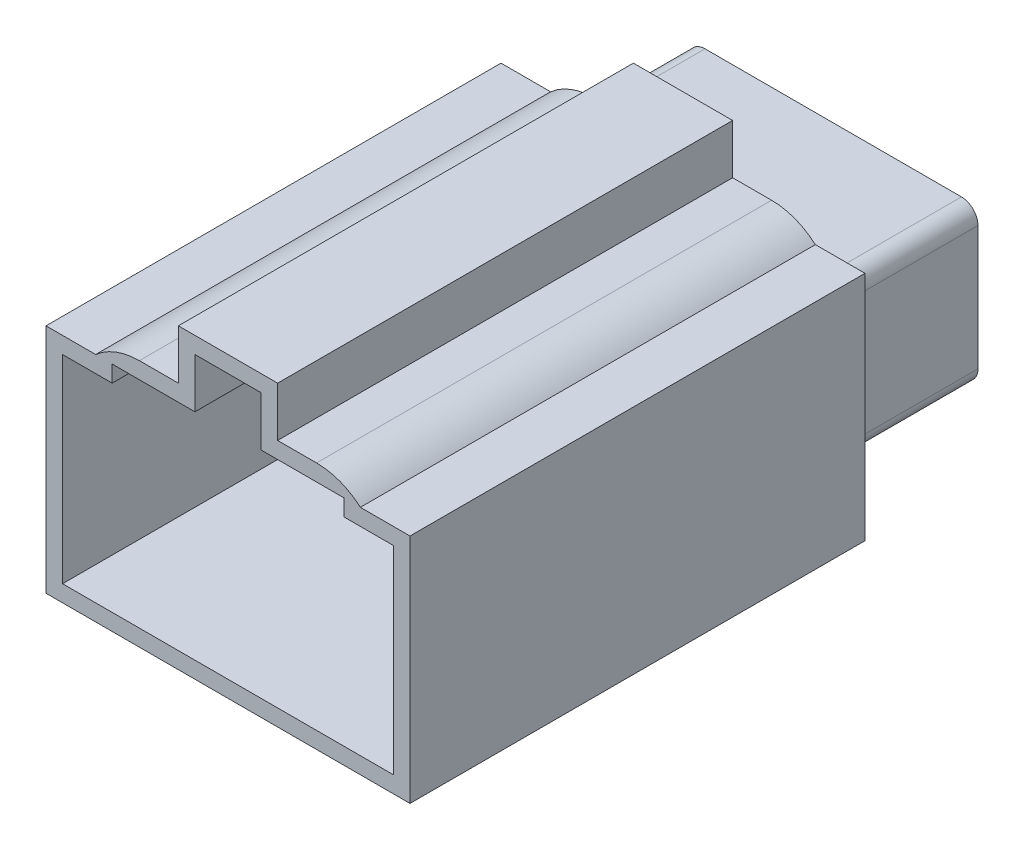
ISO-10303-21;
HEADER;
FILE_DESCRIPTION(('STEP AP214'),'2;1');
FILE_NAME('part.step','',(''),(''),'','','');
FILE_SCHEMA(('AUTOMOTIVE_DESIGN { 1 0 10303 214 1 1 1 1 }'));
ENDSEC;
DATA;
#1=APPLICATION_CONTEXT('core data for automotive mechanical design processes');
#2=APPLICATION_PROTOCOL_DEFINITION('international standard','automotive_design',2000,#1);
#3=PRODUCT_CONTEXT('',#1,'mechanical');
#4=PRODUCT('Part','Part','',(#3));
#5=PRODUCT_RELATED_PRODUCT_CATEGORY('part','',(#4));
#6=PRODUCT_DEFINITION_FORMATION('','',#4);
#7=PRODUCT_DEFINITION_CONTEXT('part definition',#1,'design');
#8=PRODUCT_DEFINITION('design','',#6,#7);
#9=PRODUCT_DEFINITION_SHAPE('','',#8);
#10=(LENGTH_UNIT() NAMED_UNIT(*) SI_UNIT(.MILLI.,.METRE.));
#11=(NAMED_UNIT(*) PLANE_ANGLE_UNIT() SI_UNIT($,.RADIAN.));
#12=(NAMED_UNIT(*) SI_UNIT($,.STERADIAN.) SOLID_ANGLE_UNIT());
#13=UNCERTAINTY_MEASURE_WITH_UNIT(LENGTH_MEASURE(1.E-05),#10,'distance_accuracy_value','');
#14=(GEOMETRIC_REPRESENTATION_CONTEXT(3) GLOBAL_UNCERTAINTY_ASSIGNED_CONTEXT((#13)) GLOBAL_UNIT_ASSIGNED_CONTEXT((#10,
#11,#12)) REPRESENTATION_CONTEXT('',''));
#15=CARTESIAN_POINT('',(0.,0.,0.));
#16=DIRECTION('',(0.,0.,1.));
#17=DIRECTION('',(1.,0.,0.));
#18=AXIS2_PLACEMENT_3D('',#15,#16,#17);
#19=CARTESIAN_POINT('',(0.,0.,5.));
#20=DIRECTION('',(0.,0.,-1.));
#21=DIRECTION('',(-1.,0.,0.));
#22=AXIS2_PLACEMENT_3D('',#19,#20,#21);
#23=PLANE('',#22);
#24=DIRECTION('',(-1.,0.,0.));
#25=VECTOR('',#24,1.);
#26=CARTESIAN_POINT('',(0.,-10.1212765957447,5.));
#27=LINE('',#26,#25);
#28=CARTESIAN_POINT('',(8.75,-10.1212765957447,5.));
#29=VERTEX_POINT('',#28);
#30=CARTESIAN_POINT('',(-11.25,-10.1212765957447,5.));
#31=VERTEX_POINT('',#30);
#32=EDGE_CURVE('E377',#29,#31,#27,.T.);
#33=ORIENTED_EDGE('',*,*,#32,.T.);
#34=DIRECTION('',(0.,1.,0.));
#35=VECTOR('',#34,1.);
#36=CARTESIAN_POINT('',(-11.25,0.,5.));
#37=LINE('',#36,#35);
#38=CARTESIAN_POINT('',(-11.25,1.87872340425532,5.));
#39=VERTEX_POINT('',#38);
#40=EDGE_CURVE('E379',#31,#39,#37,.T.);
#41=ORIENTED_EDGE('',*,*,#40,.T.);
#42=DIRECTION('',(-1.,0.,0.));
#43=VECTOR('',#42,1.);
#44=CARTESIAN_POINT('',(0.,1.87872340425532,5.));
#45=LINE('',#44,#43);
#46=CARTESIAN_POINT('',(-8.25,1.87872340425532,5.));
#47=VERTEX_POINT('',#46);
#48=EDGE_CURVE('E381',#47,#39,#45,.T.);
#49=ORIENTED_EDGE('',*,*,#48,.F.);
#50=CARTESIAN_POINT('',(5.75,1.87872340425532,5.));
#51=VERTEX_POINT('',#50);
#52=EDGE_CURVE('E386',#51,#47,#45,.T.);
#53=ORIENTED_EDGE('',*,*,#52,.F.);
#54=CARTESIAN_POINT('',(8.75,1.87872340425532,5.));
#55=VERTEX_POINT('',#54);
#56=EDGE_CURVE('E382',#55,#51,#45,.T.);
#57=ORIENTED_EDGE('',*,*,#56,.F.);
#58=DIRECTION('',(0.,1.,0.));
#59=VECTOR('',#58,1.);
#60=CARTESIAN_POINT('',(8.75,0.,5.));
#61=LINE('',#60,#59);
#62=EDGE_CURVE('E385',#29,#55,#61,.T.);
#63=ORIENTED_EDGE('',*,*,#62,.F.);
#64=EDGE_LOOP('',(#33,#41,#49,#53,#57,#63));
#65=FACE_BOUND('',#64,.T.);
#66=DIRECTION('',(1.,0.,0.));
#67=VECTOR('',#66,1.);
#68=CARTESIAN_POINT('',(0.,0.793695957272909,5.));
#69=LINE('',#68,#67);
#70=CARTESIAN_POINT('',(-8.91958696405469,0.793695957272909,5.));
#71=VERTEX_POINT('',#70);
#72=CARTESIAN_POINT('',(6.58041303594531,0.793695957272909,5.));
#73=VERTEX_POINT('',#72);
#74=EDGE_CURVE('E361',#71,#73,#69,.T.);
#75=ORIENTED_EDGE('',*,*,#74,.F.);
#76=CARTESIAN_POINT('',(-8.91958696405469,-0.206304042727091,5.));
#77=DIRECTION('',(0.,0.,-1.));
#78=DIRECTION('',(-1.,0.,0.));
#79=AXIS2_PLACEMENT_3D('',#76,#77,#78);
#80=CIRCLE('',#79,1.);
#81=CARTESIAN_POINT('',(-9.91958696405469,-0.206304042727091,5.));
#82=VERTEX_POINT('',#81);
#83=EDGE_CURVE('E11',#71,#82,#80,.F.);
#84=ORIENTED_EDGE('',*,*,#83,.T.);
#85=DIRECTION('',(0.,-1.,0.));
#86=VECTOR('',#85,1.);
#87=CARTESIAN_POINT('',(-9.91958696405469,0.,5.));
#88=LINE('',#87,#86);
#89=CARTESIAN_POINT('',(-9.91958696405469,-7.70630404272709,5.));
#90=VERTEX_POINT('',#89);
#91=EDGE_CURVE('E364',#82,#90,#88,.T.);
#92=ORIENTED_EDGE('',*,*,#91,.T.);
#93=CARTESIAN_POINT('',(-8.91958696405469,-7.70630404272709,5.));
#94=DIRECTION('',(0.,0.,-1.));
#95=DIRECTION('',(-1.,0.,0.));
#96=AXIS2_PLACEMENT_3D('',#93,#94,#95);
#97=CIRCLE('',#96,1.);
#98=CARTESIAN_POINT('',(-8.91958696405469,-8.70630404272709,5.));
#99=VERTEX_POINT('',#98);
#100=EDGE_CURVE('E43',#90,#99,#97,.F.);
#101=ORIENTED_EDGE('',*,*,#100,.T.);
#102=DIRECTION('',(1.,0.,0.));
#103=VECTOR('',#102,1.);
#104=CARTESIAN_POINT('',(0.,-8.70630404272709,5.));
#105=LINE('',#104,#103);
#106=CARTESIAN_POINT('',(6.58041303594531,-8.70630404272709,5.));
#107=VERTEX_POINT('',#106);
#108=EDGE_CURVE('E366',#99,#107,#105,.T.);
#109=ORIENTED_EDGE('',*,*,#108,.T.);
#110=CARTESIAN_POINT('',(6.58041303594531,-7.70630404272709,5.));
#111=DIRECTION('',(0.,0.,-1.));
#112=DIRECTION('',(-1.,0.,0.));
#113=AXIS2_PLACEMENT_3D('',#110,#111,#112);
#114=CIRCLE('',#113,1.);
#115=CARTESIAN_POINT('',(7.58041303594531,-7.70630404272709,5.));
#116=VERTEX_POINT('',#115);
#117=EDGE_CURVE('E622',#107,#116,#114,.F.);
#118=ORIENTED_EDGE('',*,*,#117,.T.);
#119=DIRECTION('',(0.,-1.,0.));
#120=VECTOR('',#119,1.);
#121=CARTESIAN_POINT('',(7.58041303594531,0.,5.));
#122=LINE('',#121,#120);
#123=CARTESIAN_POINT('',(7.58041303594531,-0.206304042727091,5.));
#124=VERTEX_POINT('',#123);
#125=EDGE_CURVE('E313',#124,#116,#122,.T.);
#126=ORIENTED_EDGE('',*,*,#125,.F.);
#127=CARTESIAN_POINT('',(6.58041303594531,-0.206304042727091,5.));
#128=DIRECTION('',(0.,0.,-1.));
#129=DIRECTION('',(-1.,0.,0.));
#130=AXIS2_PLACEMENT_3D('',#127,#128,#129);
#131=CIRCLE('',#130,1.);
#132=EDGE_CURVE('E624',#124,#73,#131,.F.);
#133=ORIENTED_EDGE('',*,*,#132,.T.);
#134=EDGE_LOOP('',(#75,#84,#92,#101,#109,#118,#126,#133));
#135=FACE_BOUND('',#134,.T.);
#136=ADVANCED_FACE('F35',(#65,#135),#23,.T.);
#137=CARTESIAN_POINT('',(8.75,-10.1212765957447,27.5));
#138=DIRECTION('',(-1.,0.,0.));
#139=DIRECTION('',(0.,0.,1.));
#140=AXIS2_PLACEMENT_3D('',#137,#138,#139);
#141=PLANE('',#140);
#142=DIRECTION('',(0.,0.,-1.));
#143=VECTOR('',#142,1.);
#144=CARTESIAN_POINT('',(8.75,1.87872340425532,27.5));
#145=LINE('',#144,#143);
#146=CARTESIAN_POINT('',(8.75,1.87872340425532,27.5));
#147=VERTEX_POINT('',#146);
#148=CARTESIAN_POINT('',(8.75,1.87872340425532,10.));
#149=VERTEX_POINT('',#148);
#150=EDGE_CURVE('E504',#147,#149,#145,.T.);
#151=ORIENTED_EDGE('',*,*,#150,.T.);
#152=DIRECTION('',(0.,1.,0.));
#153=VECTOR('',#152,1.);
#154=CARTESIAN_POINT('',(8.75,0.,10.));
#155=LINE('',#154,#153);
#156=CARTESIAN_POINT('',(8.75,-10.1212765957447,10.));
#157=VERTEX_POINT('',#156);
#158=EDGE_CURVE('E374',#157,#149,#155,.T.);
#159=ORIENTED_EDGE('',*,*,#158,.F.);
#160=DIRECTION('',(0.,0.,-1.));
#161=VECTOR('',#160,1.);
#162=CARTESIAN_POINT('',(8.75,-10.1212765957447,27.5));
#163=LINE('',#162,#161);
#164=CARTESIAN_POINT('',(8.75,-10.1212765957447,27.5));
#165=VERTEX_POINT('',#164);
#166=EDGE_CURVE('E472',#165,#157,#163,.T.);
#167=ORIENTED_EDGE('',*,*,#166,.F.);
#168=DIRECTION('',(0.,1.,0.));
#169=VECTOR('',#168,1.);
#170=CARTESIAN_POINT('',(8.75,-10.1212765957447,27.5));
#171=LINE('',#170,#169);
#172=EDGE_CURVE('E411',#165,#147,#171,.T.);
#173=ORIENTED_EDGE('',*,*,#172,.T.);
#174=EDGE_LOOP('',(#151,#159,#167,#173));
#175=FACE_BOUND('',#174,.T.);
#176=ADVANCED_FACE('F665',(#175),#141,.T.);
#177=CARTESIAN_POINT('',(8.75,1.87872340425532,27.5));
#178=DIRECTION('',(0.,-1.,0.));
#179=DIRECTION('',(1.,0.,0.));
#180=AXIS2_PLACEMENT_3D('',#177,#178,#179);
#181=PLANE('',#180);
#182=DIRECTION('',(0.,0.,-1.));
#183=VECTOR('',#182,1.);
#184=CARTESIAN_POINT('',(5.75,1.87872340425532,27.5));
#185=LINE('',#184,#183);
#186=CARTESIAN_POINT('',(5.75,1.87872340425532,27.5));
#187=VERTEX_POINT('',#186);
#188=CARTESIAN_POINT('',(5.75,1.87872340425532,10.));
#189=VERTEX_POINT('',#188);
#190=EDGE_CURVE('E500',#187,#189,#185,.T.);
#191=ORIENTED_EDGE('',*,*,#190,.T.);
#192=DIRECTION('',(-1.,0.,0.));
#193=VECTOR('',#192,1.);
#194=CARTESIAN_POINT('',(0.,1.87872340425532,10.));
#195=LINE('',#194,#193);
#196=EDGE_CURVE('E402',#149,#189,#195,.T.);
#197=ORIENTED_EDGE('',*,*,#196,.F.);
#198=ORIENTED_EDGE('',*,*,#150,.F.);
#199=DIRECTION('',(-1.,0.,0.));
#200=VECTOR('',#199,1.);
#201=CARTESIAN_POINT('',(8.75,1.87872340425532,27.5));
#202=LINE('',#201,#200);
#203=EDGE_CURVE('E413',#147,#187,#202,.T.);
#204=ORIENTED_EDGE('',*,*,#203,.T.);
#205=EDGE_LOOP('',(#191,#197,#198,#204));
#206=FACE_BOUND('',#205,.T.);
#207=ADVANCED_FACE('F674',(#206),#181,.T.);
#208=CARTESIAN_POINT('',(-11.25,1.87872340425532,27.5));
#209=DIRECTION('',(0.,-1.,0.));
#210=DIRECTION('',(0.,0.,-1.));
#211=AXIS2_PLACEMENT_3D('',#208,#209,#210);
#212=PLANE('',#211);
#213=DIRECTION('',(0.,0.,-1.));
#214=VECTOR('',#213,1.);
#215=CARTESIAN_POINT('',(-11.25,1.87872340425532,27.5));
#216=LINE('',#215,#214);
#217=CARTESIAN_POINT('',(-11.25,1.87872340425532,27.5));
#218=VERTEX_POINT('',#217);
#219=CARTESIAN_POINT('',(-11.25,1.87872340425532,10.));
#220=VERTEX_POINT('',#219);
#221=EDGE_CURVE('E480',#218,#220,#216,.T.);
#222=ORIENTED_EDGE('',*,*,#221,.T.);
#223=CARTESIAN_POINT('',(-8.25,1.87872340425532,10.));
#224=VERTEX_POINT('',#223);
#225=EDGE_CURVE('E401',#224,#220,#195,.T.);
#226=ORIENTED_EDGE('',*,*,#225,.F.);
#227=DIRECTION('',(0.,0.,-1.));
#228=VECTOR('',#227,1.);
#229=CARTESIAN_POINT('',(-8.25,1.87872340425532,27.5));
#230=LINE('',#229,#228);
#231=CARTESIAN_POINT('',(-8.25,1.87872340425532,27.5));
#232=VERTEX_POINT('',#231);
#233=EDGE_CURVE('E484',#232,#224,#230,.T.);
#234=ORIENTED_EDGE('',*,*,#233,.F.);
#235=DIRECTION('',(-1.,0.,0.));
#236=VECTOR('',#235,1.);
#237=CARTESIAN_POINT('',(-11.25,1.87872340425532,27.5));
#238=LINE('',#237,#236);
#239=EDGE_CURVE('E430',#232,#218,#238,.T.);
#240=ORIENTED_EDGE('',*,*,#239,.T.);
#241=EDGE_LOOP('',(#222,#226,#234,#240));
#242=FACE_BOUND('',#241,.T.);
#243=ADVANCED_FACE('F761',(#242),#212,.T.);
#244=CARTESIAN_POINT('',(-11.25,-10.1212765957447,27.5));
#245=DIRECTION('',(1.,0.,0.));
#246=DIRECTION('',(0.,0.,-1.));
#247=AXIS2_PLACEMENT_3D('',#244,#245,#246);
#248=PLANE('',#247);
#249=DIRECTION('',(0.,0.,-1.));
#250=VECTOR('',#249,1.);
#251=CARTESIAN_POINT('',(-11.25,-10.1212765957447,27.5));
#252=LINE('',#251,#250);
#253=CARTESIAN_POINT('',(-11.25,-10.1212765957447,27.5));
#254=VERTEX_POINT('',#253);
#255=CARTESIAN_POINT('',(-11.25,-10.1212765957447,10.));
#256=VERTEX_POINT('',#255);
#257=EDGE_CURVE('E476',#254,#256,#252,.T.);
#258=ORIENTED_EDGE('',*,*,#257,.T.);
#259=DIRECTION('',(0.,1.,0.));
#260=VECTOR('',#259,1.);
#261=CARTESIAN_POINT('',(-11.25,0.,10.));
#262=LINE('',#261,#260);
#263=EDGE_CURVE('E398',#256,#220,#262,.T.);
#264=ORIENTED_EDGE('',*,*,#263,.T.);
#265=ORIENTED_EDGE('',*,*,#221,.F.);
#266=DIRECTION('',(0.,-1.,0.));
#267=VECTOR('',#266,1.);
#268=CARTESIAN_POINT('',(-11.25,-10.1212765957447,27.5));
#269=LINE('',#268,#267);
#270=EDGE_CURVE('E432',#218,#254,#269,.T.);
#271=ORIENTED_EDGE('',*,*,#270,.T.);
#272=EDGE_LOOP('',(#258,#264,#265,#271));
#273=FACE_BOUND('',#272,.T.);
#274=ADVANCED_FACE('F899',(#273),#248,.T.);
#275=CARTESIAN_POINT('',(8.75,-10.1212765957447,27.5));
#276=DIRECTION('',(0.,1.,0.));
#277=DIRECTION('',(0.,0.,1.));
#278=AXIS2_PLACEMENT_3D('',#275,#276,#277);
#279=PLANE('',#278);
#280=ORIENTED_EDGE('',*,*,#166,.T.);
#281=DIRECTION('',(-1.,0.,0.));
#282=VECTOR('',#281,1.);
#283=CARTESIAN_POINT('',(0.,-10.1212765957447,10.));
#284=LINE('',#283,#282);
#285=EDGE_CURVE('E395',#157,#256,#284,.T.);
#286=ORIENTED_EDGE('',*,*,#285,.T.);
#287=ORIENTED_EDGE('',*,*,#257,.F.);
#288=DIRECTION('',(1.,0.,0.));
#289=VECTOR('',#288,1.);
#290=CARTESIAN_POINT('',(8.75,-10.1212765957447,27.5));
#291=LINE('',#290,#289);
#292=EDGE_CURVE('E435',#254,#165,#291,.T.);
#293=ORIENTED_EDGE('',*,*,#292,.T.);
#294=EDGE_LOOP('',(#280,#286,#287,#293));
#295=FACE_BOUND('',#294,.T.);
#296=ADVANCED_FACE('F711',(#295),#279,.T.);
#297=CARTESIAN_POINT('',(0.,0.,27.5));
#298=DIRECTION('',(0.,0.,-1.));
#299=DIRECTION('',(-1.,0.,0.));
#300=AXIS2_PLACEMENT_3D('',#297,#298,#299);
#301=PLANE('',#300);
#302=DIRECTION('',(-1.,0.,0.));
#303=VECTOR('',#302,1.);
#304=CARTESIAN_POINT('',(9.75,2.87872340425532,27.5));
#305=LINE('',#304,#303);
#306=CARTESIAN_POINT('',(9.75,2.87872340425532,27.5));
#307=VERTEX_POINT('',#306);
#308=CARTESIAN_POINT('',(6.75,2.87872340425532,27.5));
#309=VERTEX_POINT('',#308);
#310=EDGE_CURVE('E516',#307,#309,#305,.T.);
#311=ORIENTED_EDGE('',*,*,#310,.T.);
#312=CARTESIAN_POINT('',(4.10424868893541,-0.121276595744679,27.5));
#313=DIRECTION('',(0.,0.,-1.));
#314=DIRECTION('',(-1.,0.,0.));
#315=AXIS2_PLACEMENT_3D('',#312,#313,#314);
#316=CIRCLE('',#315,4.);
#317=CARTESIAN_POINT('',(4.10424868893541,3.87872340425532,27.5));
#318=VERTEX_POINT('',#317);
#319=EDGE_CURVE('E593',#309,#318,#316,.F.);
#320=ORIENTED_EDGE('',*,*,#319,.T.);
#321=DIRECTION('',(-1.,0.,0.));
#322=VECTOR('',#321,1.);
#323=CARTESIAN_POINT('',(6.75,3.87872340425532,27.5));
#324=LINE('',#323,#322);
#325=CARTESIAN_POINT('',(1.75,3.87872340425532,27.5));
#326=VERTEX_POINT('',#325);
#327=EDGE_CURVE('E518',#318,#326,#324,.T.);
#328=ORIENTED_EDGE('',*,*,#327,.T.);
#329=DIRECTION('',(0.,1.,0.));
#330=VECTOR('',#329,1.);
#331=CARTESIAN_POINT('',(1.75,3.87872340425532,27.5));
#332=LINE('',#331,#330);
#333=CARTESIAN_POINT('',(1.75,6.87872340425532,27.5));
#334=VERTEX_POINT('',#333);
#335=EDGE_CURVE('E520',#326,#334,#332,.T.);
#336=ORIENTED_EDGE('',*,*,#335,.T.);
#337=DIRECTION('',(-1.,0.,0.));
#338=VECTOR('',#337,1.);
#339=CARTESIAN_POINT('',(-4.25,6.87872340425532,27.5));
#340=LINE('',#339,#338);
#341=CARTESIAN_POINT('',(-4.25,6.87872340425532,27.5));
#342=VERTEX_POINT('',#341);
#343=EDGE_CURVE('E522',#334,#342,#340,.T.);
#344=ORIENTED_EDGE('',*,*,#343,.T.);
#345=DIRECTION('',(0.,-1.,0.));
#346=VECTOR('',#345,1.);
#347=CARTESIAN_POINT('',(-4.25,3.87872340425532,27.5));
#348=LINE('',#347,#346);
#349=CARTESIAN_POINT('',(-4.25,3.87872340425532,27.5));
#350=VERTEX_POINT('',#349);
#351=EDGE_CURVE('E524',#342,#350,#348,.T.);
#352=ORIENTED_EDGE('',*,*,#351,.T.);
#353=DIRECTION('',(-1.,0.,0.));
#354=VECTOR('',#353,1.);
#355=CARTESIAN_POINT('',(-9.25,3.87872340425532,27.5));
#356=LINE('',#355,#354);
#357=CARTESIAN_POINT('',(-6.60424868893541,3.87872340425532,27.5));
#358=VERTEX_POINT('',#357);
#359=EDGE_CURVE('E526',#350,#358,#356,.T.);
#360=ORIENTED_EDGE('',*,*,#359,.T.);
#361=CARTESIAN_POINT('',(-6.60424868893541,-0.121276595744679,27.5));
#362=DIRECTION('',(0.,0.,-1.));
#363=DIRECTION('',(-1.,0.,0.));
#364=AXIS2_PLACEMENT_3D('',#361,#362,#363);
#365=CIRCLE('',#364,4.);
#366=CARTESIAN_POINT('',(-9.25,2.87872340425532,27.5));
#367=VERTEX_POINT('',#366);
#368=EDGE_CURVE('E586',#358,#367,#365,.F.);
#369=ORIENTED_EDGE('',*,*,#368,.T.);
#370=DIRECTION('',(-1.,0.,0.));
#371=VECTOR('',#370,1.);
#372=CARTESIAN_POINT('',(-12.25,2.87872340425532,27.5));
#373=LINE('',#372,#371);
#374=CARTESIAN_POINT('',(-12.25,2.87872340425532,27.5));
#375=VERTEX_POINT('',#374);
#376=EDGE_CURVE('E529',#367,#375,#373,.T.);
#377=ORIENTED_EDGE('',*,*,#376,.T.);
#378=DIRECTION('',(0.,-1.,0.));
#379=VECTOR('',#378,1.);
#380=CARTESIAN_POINT('',(-12.25,-11.1212765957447,27.5));
#381=LINE('',#380,#379);
#382=CARTESIAN_POINT('',(-12.25,-11.1212765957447,27.5));
#383=VERTEX_POINT('',#382);
#384=EDGE_CURVE('E508',#375,#383,#381,.T.);
#385=ORIENTED_EDGE('',*,*,#384,.T.);
#386=DIRECTION('',(1.,0.,0.));
#387=VECTOR('',#386,1.);
#388=CARTESIAN_POINT('',(9.75,-11.1212765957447,27.5));
#389=LINE('',#388,#387);
#390=CARTESIAN_POINT('',(9.75,-11.1212765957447,27.5));
#391=VERTEX_POINT('',#390);
#392=EDGE_CURVE('E511',#383,#391,#389,.T.);
#393=ORIENTED_EDGE('',*,*,#392,.T.);
#394=DIRECTION('',(0.,1.,0.));
#395=VECTOR('',#394,1.);
#396=CARTESIAN_POINT('',(9.75,-11.1212765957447,27.5));
#397=LINE('',#396,#395);
#398=EDGE_CURVE('E514',#391,#307,#397,.T.);
#399=ORIENTED_EDGE('',*,*,#398,.T.);
#400=EDGE_LOOP('',(#311,#320,#328,#336,#344,#352,#360,#369,#377,#385,#393,#399));
#401=FACE_BOUND('',#400,.T.);
#402=ORIENTED_EDGE('',*,*,#172,.F.);
#403=ORIENTED_EDGE('',*,*,#292,.F.);
#404=ORIENTED_EDGE('',*,*,#270,.F.);
#405=ORIENTED_EDGE('',*,*,#239,.F.);
#406=DIRECTION('',(0.,-1.,0.));
#407=VECTOR('',#406,1.);
#408=CARTESIAN_POINT('',(-8.25,1.87872340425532,27.5));
#409=LINE('',#408,#407);
#410=CARTESIAN_POINT('',(-8.25,2.87872340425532,27.5));
#411=VERTEX_POINT('',#410);
#412=EDGE_CURVE('E428',#411,#232,#409,.T.);
#413=ORIENTED_EDGE('',*,*,#412,.F.);
#414=DIRECTION('',(-1.,0.,0.));
#415=VECTOR('',#414,1.);
#416=CARTESIAN_POINT('',(-8.25,2.87872340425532,27.5));
#417=LINE('',#416,#415);
#418=CARTESIAN_POINT('',(-3.25,2.87872340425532,27.5));
#419=VERTEX_POINT('',#418);
#420=EDGE_CURVE('E426',#419,#411,#417,.T.);
#421=ORIENTED_EDGE('',*,*,#420,.F.);
#422=DIRECTION('',(0.,-1.,0.));
#423=VECTOR('',#422,1.);
#424=CARTESIAN_POINT('',(-3.25,2.87872340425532,27.5));
#425=LINE('',#424,#423);
#426=CARTESIAN_POINT('',(-3.25,5.87872340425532,27.5));
#427=VERTEX_POINT('',#426);
#428=EDGE_CURVE('E424',#427,#419,#425,.T.);
#429=ORIENTED_EDGE('',*,*,#428,.F.);
#430=DIRECTION('',(-1.,0.,0.));
#431=VECTOR('',#430,1.);
#432=CARTESIAN_POINT('',(-3.25,5.87872340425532,27.5));
#433=LINE('',#432,#431);
#434=CARTESIAN_POINT('',(0.750000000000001,5.87872340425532,27.5));
#435=VERTEX_POINT('',#434);
#436=EDGE_CURVE('E422',#435,#427,#433,.T.);
#437=ORIENTED_EDGE('',*,*,#436,.F.);
#438=DIRECTION('',(0.,1.,0.));
#439=VECTOR('',#438,1.);
#440=CARTESIAN_POINT('',(0.750000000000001,2.87872340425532,27.5));
#441=LINE('',#440,#439);
#442=CARTESIAN_POINT('',(0.750000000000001,2.87872340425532,27.5));
#443=VERTEX_POINT('',#442);
#444=EDGE_CURVE('E420',#443,#435,#441,.T.);
#445=ORIENTED_EDGE('',*,*,#444,.F.);
#446=DIRECTION('',(-1.,0.,0.));
#447=VECTOR('',#446,1.);
#448=CARTESIAN_POINT('',(5.75,2.87872340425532,27.5));
#449=LINE('',#448,#447);
#450=CARTESIAN_POINT('',(5.75,2.87872340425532,27.5));
#451=VERTEX_POINT('',#450);
#452=EDGE_CURVE('E418',#451,#443,#449,.T.);
#453=ORIENTED_EDGE('',*,*,#452,.F.);
#454=DIRECTION('',(0.,1.,0.));
#455=VECTOR('',#454,1.);
#456=CARTESIAN_POINT('',(5.75,1.87872340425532,27.5));
#457=LINE('',#456,#455);
#458=EDGE_CURVE('E416',#187,#451,#457,.T.);
#459=ORIENTED_EDGE('',*,*,#458,.F.);
#460=ORIENTED_EDGE('',*,*,#203,.F.);
#461=EDGE_LOOP('',(#402,#403,#404,#405,#413,#421,#429,#437,#445,#453,#459,#460));
#462=FACE_BOUND('',#461,.T.);
#463=ADVANCED_FACE('F715',(#401,#462),#301,.F.);
#464=CARTESIAN_POINT('',(0.,0.,0.));
#465=DIRECTION('',(0.,0.,-1.));
#466=DIRECTION('',(-1.,0.,0.));
#467=AXIS2_PLACEMENT_3D('',#464,#465,#466);
#468=PLANE('',#467);
#469=DIRECTION('',(-1.,0.,0.));
#470=VECTOR('',#469,1.);
#471=CARTESIAN_POINT('',(6.75,3.87872340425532,0.));
#472=LINE('',#471,#470);
#473=CARTESIAN_POINT('',(4.10424868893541,3.87872340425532,0.));
#474=VERTEX_POINT('',#473);
#475=CARTESIAN_POINT('',(1.75,3.87872340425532,0.));
#476=VERTEX_POINT('',#475);
#477=EDGE_CURVE('E541',#474,#476,#472,.T.);
#478=ORIENTED_EDGE('',*,*,#477,.F.);
#479=CARTESIAN_POINT('',(4.10424868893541,-0.121276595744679,0.));
#480=DIRECTION('',(0.,0.,-1.));
#481=DIRECTION('',(-1.,0.,0.));
#482=AXIS2_PLACEMENT_3D('',#479,#480,#481);
#483=CIRCLE('',#482,4.);
#484=CARTESIAN_POINT('',(6.75,2.87872340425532,0.));
#485=VERTEX_POINT('',#484);
#486=EDGE_CURVE('E591',#474,#485,#483,.T.);
#487=ORIENTED_EDGE('',*,*,#486,.T.);
#488=DIRECTION('',(-1.,0.,0.));
#489=VECTOR('',#488,1.);
#490=CARTESIAN_POINT('',(9.75,2.87872340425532,0.));
#491=LINE('',#490,#489);
#492=CARTESIAN_POINT('',(9.75,2.87872340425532,0.));
#493=VERTEX_POINT('',#492);
#494=EDGE_CURVE('E538',#493,#485,#491,.T.);
#495=ORIENTED_EDGE('',*,*,#494,.F.);
#496=DIRECTION('',(0.,1.,0.));
#497=VECTOR('',#496,1.);
#498=CARTESIAN_POINT('',(9.75,-11.1212765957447,0.));
#499=LINE('',#498,#497);
#500=CARTESIAN_POINT('',(9.75,-11.1212765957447,0.));
#501=VERTEX_POINT('',#500);
#502=EDGE_CURVE('E536',#501,#493,#499,.T.);
#503=ORIENTED_EDGE('',*,*,#502,.F.);
#504=DIRECTION('',(1.,0.,0.));
#505=VECTOR('',#504,1.);
#506=CARTESIAN_POINT('',(9.75,-11.1212765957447,0.));
#507=LINE('',#506,#505);
#508=CARTESIAN_POINT('',(-12.25,-11.1212765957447,0.));
#509=VERTEX_POINT('',#508);
#510=EDGE_CURVE('E534',#509,#501,#507,.T.);
#511=ORIENTED_EDGE('',*,*,#510,.F.);
#512=DIRECTION('',(0.,-1.,0.));
#513=VECTOR('',#512,1.);
#514=CARTESIAN_POINT('',(-12.25,-11.1212765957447,0.));
#515=LINE('',#514,#513);
#516=CARTESIAN_POINT('',(-12.25,2.87872340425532,0.));
#517=VERTEX_POINT('',#516);
#518=EDGE_CURVE('E507',#517,#509,#515,.T.);
#519=ORIENTED_EDGE('',*,*,#518,.F.);
#520=DIRECTION('',(-1.,0.,0.));
#521=VECTOR('',#520,1.);
#522=CARTESIAN_POINT('',(-12.25,2.87872340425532,0.));
#523=LINE('',#522,#521);
#524=CARTESIAN_POINT('',(-9.25,2.87872340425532,0.));
#525=VERTEX_POINT('',#524);
#526=EDGE_CURVE('E512',#525,#517,#523,.T.);
#527=ORIENTED_EDGE('',*,*,#526,.F.);
#528=CARTESIAN_POINT('',(-6.60424868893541,-0.121276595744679,0.));
#529=DIRECTION('',(0.,0.,-1.));
#530=DIRECTION('',(-1.,0.,0.));
#531=AXIS2_PLACEMENT_3D('',#528,#529,#530);
#532=CIRCLE('',#531,4.);
#533=CARTESIAN_POINT('',(-6.60424868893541,3.87872340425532,0.));
#534=VERTEX_POINT('',#533);
#535=EDGE_CURVE('E582',#525,#534,#532,.T.);
#536=ORIENTED_EDGE('',*,*,#535,.T.);
#537=DIRECTION('',(-1.,0.,0.));
#538=VECTOR('',#537,1.);
#539=CARTESIAN_POINT('',(-9.25,3.87872340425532,0.));
#540=LINE('',#539,#538);
#541=CARTESIAN_POINT('',(-4.25,3.87872340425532,0.));
#542=VERTEX_POINT('',#541);
#543=EDGE_CURVE('E549',#542,#534,#540,.T.);
#544=ORIENTED_EDGE('',*,*,#543,.F.);
#545=DIRECTION('',(0.,-1.,0.));
#546=VECTOR('',#545,1.);
#547=CARTESIAN_POINT('',(-4.25,3.87872340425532,0.));
#548=LINE('',#547,#546);
#549=CARTESIAN_POINT('',(-4.25,6.87872340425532,0.));
#550=VERTEX_POINT('',#549);
#551=EDGE_CURVE('E547',#550,#542,#548,.T.);
#552=ORIENTED_EDGE('',*,*,#551,.F.);
#553=DIRECTION('',(-1.,0.,0.));
#554=VECTOR('',#553,1.);
#555=CARTESIAN_POINT('',(-4.25,6.87872340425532,0.));
#556=LINE('',#555,#554);
#557=CARTESIAN_POINT('',(1.75,6.87872340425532,0.));
#558=VERTEX_POINT('',#557);
#559=EDGE_CURVE('E545',#558,#550,#556,.T.);
#560=ORIENTED_EDGE('',*,*,#559,.F.);
#561=DIRECTION('',(0.,1.,0.));
#562=VECTOR('',#561,1.);
#563=CARTESIAN_POINT('',(1.75,3.87872340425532,0.));
#564=LINE('',#563,#562);
#565=EDGE_CURVE('E543',#476,#558,#564,.T.);
#566=ORIENTED_EDGE('',*,*,#565,.F.);
#567=EDGE_LOOP('',(#478,#487,#495,#503,#511,#519,#527,#536,#544,#552,#560,#566));
#568=FACE_BOUND('',#567,.T.);
#569=DIRECTION('',(1.,0.,0.));
#570=VECTOR('',#569,1.);
#571=CARTESIAN_POINT('',(8.75,-10.1212765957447,0.));
#572=LINE('',#571,#570);
#573=CARTESIAN_POINT('',(-11.25,-10.1212765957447,0.));
#574=VERTEX_POINT('',#573);
#575=CARTESIAN_POINT('',(8.75,-10.1212765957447,0.));
#576=VERTEX_POINT('',#575);
#577=EDGE_CURVE('E414',#574,#576,#572,.T.);
#578=ORIENTED_EDGE('',*,*,#577,.T.);
#579=DIRECTION('',(0.,1.,0.));
#580=VECTOR('',#579,1.);
#581=CARTESIAN_POINT('',(8.75,-10.1212765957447,0.));
#582=LINE('',#581,#580);
#583=CARTESIAN_POINT('',(8.75,1.87872340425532,0.));
#584=VERTEX_POINT('',#583);
#585=EDGE_CURVE('E410',#576,#584,#582,.T.);
#586=ORIENTED_EDGE('',*,*,#585,.T.);
#587=DIRECTION('',(-1.,0.,0.));
#588=VECTOR('',#587,1.);
#589=CARTESIAN_POINT('',(8.75,1.87872340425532,0.));
#590=LINE('',#589,#588);
#591=CARTESIAN_POINT('',(5.75,1.87872340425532,0.));
#592=VERTEX_POINT('',#591);
#593=EDGE_CURVE('E440',#584,#592,#590,.T.);
#594=ORIENTED_EDGE('',*,*,#593,.T.);
#595=DIRECTION('',(0.,1.,0.));
#596=VECTOR('',#595,1.);
#597=CARTESIAN_POINT('',(5.75,1.87872340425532,0.));
#598=LINE('',#597,#596);
#599=CARTESIAN_POINT('',(5.75,2.87872340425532,0.));
#600=VERTEX_POINT('',#599);
#601=EDGE_CURVE('E443',#592,#600,#598,.T.);
#602=ORIENTED_EDGE('',*,*,#601,.T.);
#603=DIRECTION('',(-1.,0.,0.));
#604=VECTOR('',#603,1.);
#605=CARTESIAN_POINT('',(5.75,2.87872340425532,0.));
#606=LINE('',#605,#604);
#607=CARTESIAN_POINT('',(0.750000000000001,2.87872340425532,0.));
#608=VERTEX_POINT('',#607);
#609=EDGE_CURVE('E446',#600,#608,#606,.T.);
#610=ORIENTED_EDGE('',*,*,#609,.T.);
#611=DIRECTION('',(0.,1.,0.));
#612=VECTOR('',#611,1.);
#613=CARTESIAN_POINT('',(0.750000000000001,2.87872340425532,0.));
#614=LINE('',#613,#612);
#615=CARTESIAN_POINT('',(0.750000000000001,5.87872340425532,0.));
#616=VERTEX_POINT('',#615);
#617=EDGE_CURVE('E449',#608,#616,#614,.T.);
#618=ORIENTED_EDGE('',*,*,#617,.T.);
#619=DIRECTION('',(-1.,0.,0.));
#620=VECTOR('',#619,1.);
#621=CARTESIAN_POINT('',(-3.25,5.87872340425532,0.));
#622=LINE('',#621,#620);
#623=CARTESIAN_POINT('',(-3.25,5.87872340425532,0.));
#624=VERTEX_POINT('',#623);
#625=EDGE_CURVE('E452',#616,#624,#622,.T.);
#626=ORIENTED_EDGE('',*,*,#625,.T.);
#627=DIRECTION('',(0.,-1.,0.));
#628=VECTOR('',#627,1.);
#629=CARTESIAN_POINT('',(-3.25,2.87872340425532,0.));
#630=LINE('',#629,#628);
#631=CARTESIAN_POINT('',(-3.25,2.87872340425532,0.));
#632=VERTEX_POINT('',#631);
#633=EDGE_CURVE('E455',#624,#632,#630,.T.);
#634=ORIENTED_EDGE('',*,*,#633,.T.);
#635=DIRECTION('',(-1.,0.,0.));
#636=VECTOR('',#635,1.);
#637=CARTESIAN_POINT('',(-8.25,2.87872340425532,0.));
#638=LINE('',#637,#636);
#639=CARTESIAN_POINT('',(-8.25,2.87872340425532,0.));
#640=VERTEX_POINT('',#639);
#641=EDGE_CURVE('E458',#632,#640,#638,.T.);
#642=ORIENTED_EDGE('',*,*,#641,.T.);
#643=DIRECTION('',(0.,-1.,0.));
#644=VECTOR('',#643,1.);
#645=CARTESIAN_POINT('',(-8.25,1.87872340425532,0.));
#646=LINE('',#645,#644);
#647=CARTESIAN_POINT('',(-8.25,1.87872340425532,0.));
#648=VERTEX_POINT('',#647);
#649=EDGE_CURVE('E461',#640,#648,#646,.T.);
#650=ORIENTED_EDGE('',*,*,#649,.T.);
#651=DIRECTION('',(-1.,0.,0.));
#652=VECTOR('',#651,1.);
#653=CARTESIAN_POINT('',(-11.25,1.87872340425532,0.));
#654=LINE('',#653,#652);
#655=CARTESIAN_POINT('',(-11.25,1.87872340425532,0.));
#656=VERTEX_POINT('',#655);
#657=EDGE_CURVE('E464',#648,#656,#654,.T.);
#658=ORIENTED_EDGE('',*,*,#657,.T.);
#659=DIRECTION('',(0.,-1.,0.));
#660=VECTOR('',#659,1.);
#661=CARTESIAN_POINT('',(-11.25,-10.1212765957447,0.));
#662=LINE('',#661,#660);
#663=EDGE_CURVE('E467',#656,#574,#662,.T.);
#664=ORIENTED_EDGE('',*,*,#663,.T.);
#665=EDGE_LOOP('',(#578,#586,#594,#602,#610,#618,#626,#634,#642,#650,#658,#664));
#666=FACE_BOUND('',#665,.T.);
#667=ADVANCED_FACE('F771',(#568,#666),#468,.T.);
#668=CARTESIAN_POINT('',(-12.25,-11.1212765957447,27.5));
#669=DIRECTION('',(1.,0.,0.));
#670=DIRECTION('',(0.,0.,-1.));
#671=AXIS2_PLACEMENT_3D('',#668,#669,#670);
#672=PLANE('',#671);
#673=ORIENTED_EDGE('',*,*,#518,.T.);
#674=DIRECTION('',(0.,0.,-1.));
#675=VECTOR('',#674,1.);
#676=CARTESIAN_POINT('',(-12.25,-11.1212765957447,27.5));
#677=LINE('',#676,#675);
#678=EDGE_CURVE('E579',#383,#509,#677,.T.);
#679=ORIENTED_EDGE('',*,*,#678,.F.);
#680=ORIENTED_EDGE('',*,*,#384,.F.);
#681=DIRECTION('',(0.,0.,-1.));
#682=VECTOR('',#681,1.);
#683=CARTESIAN_POINT('',(-12.25,2.87872340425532,27.5));
#684=LINE('',#683,#682);
#685=EDGE_CURVE('E531',#375,#517,#684,.T.);
#686=ORIENTED_EDGE('',*,*,#685,.T.);
#687=EDGE_LOOP('',(#673,#679,#680,#686));
#688=FACE_BOUND('',#687,.T.);
#689=ADVANCED_FACE('F810',(#688),#672,.F.);
#690=CARTESIAN_POINT('',(9.75,-11.1212765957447,27.5));
#691=DIRECTION('',(0.,1.,0.));
#692=DIRECTION('',(0.,0.,1.));
#693=AXIS2_PLACEMENT_3D('',#690,#691,#692);
#694=PLANE('',#693);
#695=ORIENTED_EDGE('',*,*,#510,.T.);
#696=DIRECTION('',(0.,0.,-1.));
#697=VECTOR('',#696,1.);
#698=CARTESIAN_POINT('',(9.75,-11.1212765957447,27.5));
#699=LINE('',#698,#697);
#700=EDGE_CURVE('E576',#391,#501,#699,.T.);
#701=ORIENTED_EDGE('',*,*,#700,.F.);
#702=ORIENTED_EDGE('',*,*,#392,.F.);
#703=ORIENTED_EDGE('',*,*,#678,.T.);
#704=EDGE_LOOP('',(#695,#701,#702,#703));
#705=FACE_BOUND('',#704,.T.);
#706=ADVANCED_FACE('F842',(#705),#694,.F.);
#707=CARTESIAN_POINT('',(9.75,-11.1212765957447,27.5));
#708=DIRECTION('',(-1.,0.,0.));
#709=DIRECTION('',(0.,0.,1.));
#710=AXIS2_PLACEMENT_3D('',#707,#708,#709);
#711=PLANE('',#710);
#712=ORIENTED_EDGE('',*,*,#502,.T.);
#713=DIRECTION('',(0.,0.,-1.));
#714=VECTOR('',#713,1.);
#715=CARTESIAN_POINT('',(9.75,2.87872340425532,27.5));
#716=LINE('',#715,#714);
#717=EDGE_CURVE('E573',#307,#493,#716,.T.);
#718=ORIENTED_EDGE('',*,*,#717,.F.);
#719=ORIENTED_EDGE('',*,*,#398,.F.);
#720=ORIENTED_EDGE('',*,*,#700,.T.);
#721=EDGE_LOOP('',(#712,#718,#719,#720));
#722=FACE_BOUND('',#721,.T.);
#723=ADVANCED_FACE('F838',(#722),#711,.F.);
#724=CARTESIAN_POINT('',(9.75,2.87872340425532,27.5));
#725=DIRECTION('',(0.,-1.,0.));
#726=DIRECTION('',(0.,0.,-1.));
#727=AXIS2_PLACEMENT_3D('',#724,#725,#726);
#728=PLANE('',#727);
#729=ORIENTED_EDGE('',*,*,#494,.T.);
#730=DIRECTION('',(0.,0.,-1.));
#731=VECTOR('',#730,1.);
#732=CARTESIAN_POINT('',(6.75,2.87872340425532,27.5));
#733=LINE('',#732,#731);
#734=EDGE_CURVE('E570',#309,#485,#733,.T.);
#735=ORIENTED_EDGE('',*,*,#734,.F.);
#736=ORIENTED_EDGE('',*,*,#310,.F.);
#737=ORIENTED_EDGE('',*,*,#717,.T.);
#738=EDGE_LOOP('',(#729,#735,#736,#737));
#739=FACE_BOUND('',#738,.T.);
#740=ADVANCED_FACE('F834',(#739),#728,.F.);
#741=CARTESIAN_POINT('',(6.75,3.87872340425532,27.5));
#742=DIRECTION('',(0.,-1.,0.));
#743=DIRECTION('',(1.,0.,0.));
#744=AXIS2_PLACEMENT_3D('',#741,#742,#743);
#745=PLANE('',#744);
#746=ORIENTED_EDGE('',*,*,#327,.F.);
#747=DIRECTION('',(0.,0.,1.));
#748=VECTOR('',#747,1.);
#749=CARTESIAN_POINT('',(4.10424868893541,3.87872340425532,27.5));
#750=LINE('',#749,#748);
#751=EDGE_CURVE('E588',#318,#474,#750,.F.);
#752=ORIENTED_EDGE('',*,*,#751,.T.);
#753=ORIENTED_EDGE('',*,*,#477,.T.);
#754=DIRECTION('',(0.,0.,-1.));
#755=VECTOR('',#754,1.);
#756=CARTESIAN_POINT('',(1.75,3.87872340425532,27.5));
#757=LINE('',#756,#755);
#758=EDGE_CURVE('E567',#326,#476,#757,.T.);
#759=ORIENTED_EDGE('',*,*,#758,.F.);
#760=EDGE_LOOP('',(#746,#752,#753,#759));
#761=FACE_BOUND('',#760,.T.);
#762=ADVANCED_FACE('F830',(#761),#745,.F.);
#763=CARTESIAN_POINT('',(1.75,3.87872340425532,27.5));
#764=DIRECTION('',(-1.,0.,0.));
#765=DIRECTION('',(0.,-1.,0.));
#766=AXIS2_PLACEMENT_3D('',#763,#764,#765);
#767=PLANE('',#766);
#768=ORIENTED_EDGE('',*,*,#565,.T.);
#769=DIRECTION('',(0.,0.,-1.));
#770=VECTOR('',#769,1.);
#771=CARTESIAN_POINT('',(1.75,6.87872340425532,27.5));
#772=LINE('',#771,#770);
#773=EDGE_CURVE('E564',#334,#558,#772,.T.);
#774=ORIENTED_EDGE('',*,*,#773,.F.);
#775=ORIENTED_EDGE('',*,*,#335,.F.);
#776=ORIENTED_EDGE('',*,*,#758,.T.);
#777=EDGE_LOOP('',(#768,#774,#775,#776));
#778=FACE_BOUND('',#777,.T.);
#779=ADVANCED_FACE('F826',(#778),#767,.F.);
#780=CARTESIAN_POINT('',(-4.25,6.87872340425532,27.5));
#781=DIRECTION('',(0.,-1.,0.));
#782=DIRECTION('',(0.,0.,-1.));
#783=AXIS2_PLACEMENT_3D('',#780,#781,#782);
#784=PLANE('',#783);
#785=ORIENTED_EDGE('',*,*,#559,.T.);
#786=DIRECTION('',(0.,0.,-1.));
#787=VECTOR('',#786,1.);
#788=CARTESIAN_POINT('',(-4.25,6.87872340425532,27.5));
#789=LINE('',#788,#787);
#790=EDGE_CURVE('E561',#342,#550,#789,.T.);
#791=ORIENTED_EDGE('',*,*,#790,.F.);
#792=ORIENTED_EDGE('',*,*,#343,.F.);
#793=ORIENTED_EDGE('',*,*,#773,.T.);
#794=EDGE_LOOP('',(#785,#791,#792,#793));
#795=FACE_BOUND('',#794,.T.);
#796=ADVANCED_FACE('F822',(#795),#784,.F.);
#797=CARTESIAN_POINT('',(-4.25,3.87872340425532,27.5));
#798=DIRECTION('',(1.,0.,0.));
#799=DIRECTION('',(0.,1.,0.));
#800=AXIS2_PLACEMENT_3D('',#797,#798,#799);
#801=PLANE('',#800);
#802=ORIENTED_EDGE('',*,*,#551,.T.);
#803=DIRECTION('',(0.,0.,-1.));
#804=VECTOR('',#803,1.);
#805=CARTESIAN_POINT('',(-4.25,3.87872340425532,27.5));
#806=LINE('',#805,#804);
#807=EDGE_CURVE('E558',#350,#542,#806,.T.);
#808=ORIENTED_EDGE('',*,*,#807,.F.);
#809=ORIENTED_EDGE('',*,*,#351,.F.);
#810=ORIENTED_EDGE('',*,*,#790,.T.);
#811=EDGE_LOOP('',(#802,#808,#809,#810));
#812=FACE_BOUND('',#811,.T.);
#813=ADVANCED_FACE('F818',(#812),#801,.F.);
#814=CARTESIAN_POINT('',(-9.25,3.87872340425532,27.5));
#815=DIRECTION('',(0.,-1.,0.));
#816=DIRECTION('',(1.,0.,0.));
#817=AXIS2_PLACEMENT_3D('',#814,#815,#816);
#818=PLANE('',#817);
#819=ORIENTED_EDGE('',*,*,#543,.T.);
#820=DIRECTION('',(0.,0.,-1.));
#821=VECTOR('',#820,1.);
#822=CARTESIAN_POINT('',(-6.60424868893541,3.87872340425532,27.5));
#823=LINE('',#822,#821);
#824=EDGE_CURVE('E584',#534,#358,#823,.F.);
#825=ORIENTED_EDGE('',*,*,#824,.T.);
#826=ORIENTED_EDGE('',*,*,#359,.F.);
#827=ORIENTED_EDGE('',*,*,#807,.T.);
#828=EDGE_LOOP('',(#819,#825,#826,#827));
#829=FACE_BOUND('',#828,.T.);
#830=ADVANCED_FACE('F814',(#829),#818,.F.);
#831=CARTESIAN_POINT('',(-12.25,2.87872340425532,27.5));
#832=DIRECTION('',(0.,-1.,0.));
#833=DIRECTION('',(0.,0.,-1.));
#834=AXIS2_PLACEMENT_3D('',#831,#832,#833);
#835=PLANE('',#834);
#836=ORIENTED_EDGE('',*,*,#526,.T.);
#837=ORIENTED_EDGE('',*,*,#685,.F.);
#838=ORIENTED_EDGE('',*,*,#376,.F.);
#839=DIRECTION('',(0.,0.,-1.));
#840=VECTOR('',#839,1.);
#841=CARTESIAN_POINT('',(-9.25,2.87872340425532,27.5));
#842=LINE('',#841,#840);
#843=EDGE_CURVE('E555',#367,#525,#842,.T.);
#844=ORIENTED_EDGE('',*,*,#843,.T.);
#845=EDGE_LOOP('',(#836,#837,#838,#844));
#846=FACE_BOUND('',#845,.T.);
#847=ADVANCED_FACE('F804',(#846),#835,.F.);
#848=ORIENTED_EDGE('',*,*,#62,.T.);
#849=EDGE_CURVE('E503',#55,#584,#145,.T.);
#850=ORIENTED_EDGE('',*,*,#849,.T.);
#851=ORIENTED_EDGE('',*,*,#585,.F.);
#852=EDGE_CURVE('E437',#29,#576,#163,.T.);
#853=ORIENTED_EDGE('',*,*,#852,.F.);
#854=EDGE_LOOP('',(#848,#850,#851,#853));
#855=FACE_BOUND('',#854,.T.);
#856=ADVANCED_FACE('F677',(#855),#141,.T.);
#857=ORIENTED_EDGE('',*,*,#56,.T.);
#858=EDGE_CURVE('E499',#51,#592,#185,.T.);
#859=ORIENTED_EDGE('',*,*,#858,.T.);
#860=ORIENTED_EDGE('',*,*,#593,.F.);
#861=ORIENTED_EDGE('',*,*,#849,.F.);
#862=EDGE_LOOP('',(#857,#859,#860,#861));
#863=FACE_BOUND('',#862,.T.);
#864=ADVANCED_FACE('F735',(#863),#181,.T.);
#865=CARTESIAN_POINT('',(5.75,1.87872340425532,27.5));
#866=DIRECTION('',(-1.,0.,0.));
#867=DIRECTION('',(0.,0.,1.));
#868=AXIS2_PLACEMENT_3D('',#865,#866,#867);
#869=PLANE('',#868);
#870=ORIENTED_EDGE('',*,*,#601,.F.);
#871=ORIENTED_EDGE('',*,*,#858,.F.);
#872=DIRECTION('',(0.,0.,-1.));
#873=VECTOR('',#872,1.);
#874=CARTESIAN_POINT('',(5.75,1.87872340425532,27.5));
#875=LINE('',#874,#873);
#876=EDGE_CURVE('E408',#189,#51,#875,.T.);
#877=ORIENTED_EDGE('',*,*,#876,.F.);
#878=ORIENTED_EDGE('',*,*,#190,.F.);
#879=ORIENTED_EDGE('',*,*,#458,.T.);
#880=DIRECTION('',(0.,0.,-1.));
#881=VECTOR('',#880,1.);
#882=CARTESIAN_POINT('',(5.75,2.87872340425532,27.5));
#883=LINE('',#882,#881);
#884=EDGE_CURVE('E497',#451,#600,#883,.T.);
#885=ORIENTED_EDGE('',*,*,#884,.T.);
#886=EDGE_LOOP('',(#870,#871,#877,#878,#879,#885));
#887=FACE_BOUND('',#886,.T.);
#888=ADVANCED_FACE('F727',(#887),#869,.T.);
#889=CARTESIAN_POINT('',(5.75,2.87872340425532,27.5));
#890=DIRECTION('',(0.,-1.,0.));
#891=DIRECTION('',(0.,0.,-1.));
#892=AXIS2_PLACEMENT_3D('',#889,#890,#891);
#893=PLANE('',#892);
#894=ORIENTED_EDGE('',*,*,#609,.F.);
#895=ORIENTED_EDGE('',*,*,#884,.F.);
#896=ORIENTED_EDGE('',*,*,#452,.T.);
#897=DIRECTION('',(0.,0.,-1.));
#898=VECTOR('',#897,1.);
#899=CARTESIAN_POINT('',(0.750000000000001,2.87872340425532,27.5));
#900=LINE('',#899,#898);
#901=EDGE_CURVE('E495',#443,#608,#900,.T.);
#902=ORIENTED_EDGE('',*,*,#901,.T.);
#903=EDGE_LOOP('',(#894,#895,#896,#902));
#904=FACE_BOUND('',#903,.T.);
#905=ADVANCED_FACE('F788',(#904),#893,.T.);
#906=CARTESIAN_POINT('',(0.750000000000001,2.87872340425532,27.5));
#907=DIRECTION('',(-1.,0.,0.));
#908=DIRECTION('',(0.,0.,1.));
#909=AXIS2_PLACEMENT_3D('',#906,#907,#908);
#910=PLANE('',#909);
#911=ORIENTED_EDGE('',*,*,#617,.F.);
#912=ORIENTED_EDGE('',*,*,#901,.F.);
#913=ORIENTED_EDGE('',*,*,#444,.T.);
#914=DIRECTION('',(0.,0.,-1.));
#915=VECTOR('',#914,1.);
#916=CARTESIAN_POINT('',(0.750000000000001,5.87872340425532,27.5));
#917=LINE('',#916,#915);
#918=EDGE_CURVE('E493',#435,#616,#917,.T.);
#919=ORIENTED_EDGE('',*,*,#918,.T.);
#920=EDGE_LOOP('',(#911,#912,#913,#919));
#921=FACE_BOUND('',#920,.T.);
#922=ADVANCED_FACE('F785',(#921),#910,.T.);
#923=CARTESIAN_POINT('',(-3.25,5.87872340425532,27.5));
#924=DIRECTION('',(0.,-1.,0.));
#925=DIRECTION('',(0.,0.,-1.));
#926=AXIS2_PLACEMENT_3D('',#923,#924,#925);
#927=PLANE('',#926);
#928=ORIENTED_EDGE('',*,*,#625,.F.);
#929=ORIENTED_EDGE('',*,*,#918,.F.);
#930=ORIENTED_EDGE('',*,*,#436,.T.);
#931=DIRECTION('',(0.,0.,-1.));
#932=VECTOR('',#931,1.);
#933=CARTESIAN_POINT('',(-3.25,5.87872340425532,27.5));
#934=LINE('',#933,#932);
#935=EDGE_CURVE('E491',#427,#624,#934,.T.);
#936=ORIENTED_EDGE('',*,*,#935,.T.);
#937=EDGE_LOOP('',(#928,#929,#930,#936));
#938=FACE_BOUND('',#937,.T.);
#939=ADVANCED_FACE('F778',(#938),#927,.T.);
#940=CARTESIAN_POINT('',(-3.25,2.87872340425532,27.5));
#941=DIRECTION('',(1.,0.,0.));
#942=DIRECTION('',(0.,0.,-1.));
#943=AXIS2_PLACEMENT_3D('',#940,#941,#942);
#944=PLANE('',#943);
#945=ORIENTED_EDGE('',*,*,#633,.F.);
#946=ORIENTED_EDGE('',*,*,#935,.F.);
#947=ORIENTED_EDGE('',*,*,#428,.T.);
#948=DIRECTION('',(0.,0.,-1.));
#949=VECTOR('',#948,1.);
#950=CARTESIAN_POINT('',(-3.25,2.87872340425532,27.5));
#951=LINE('',#950,#949);
#952=EDGE_CURVE('E489',#419,#632,#951,.T.);
#953=ORIENTED_EDGE('',*,*,#952,.T.);
#954=EDGE_LOOP('',(#945,#946,#947,#953));
#955=FACE_BOUND('',#954,.T.);
#956=ADVANCED_FACE('F776',(#955),#944,.T.);
#957=CARTESIAN_POINT('',(-8.25,2.87872340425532,27.5));
#958=DIRECTION('',(0.,-1.,0.));
#959=DIRECTION('',(0.,0.,-1.));
#960=AXIS2_PLACEMENT_3D('',#957,#958,#959);
#961=PLANE('',#960);
#962=ORIENTED_EDGE('',*,*,#641,.F.);
#963=ORIENTED_EDGE('',*,*,#952,.F.);
#964=ORIENTED_EDGE('',*,*,#420,.T.);
#965=DIRECTION('',(0.,0.,-1.));
#966=VECTOR('',#965,1.);
#967=CARTESIAN_POINT('',(-8.25,2.87872340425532,27.5));
#968=LINE('',#967,#966);
#969=EDGE_CURVE('E487',#411,#640,#968,.T.);
#970=ORIENTED_EDGE('',*,*,#969,.T.);
#971=EDGE_LOOP('',(#962,#963,#964,#970));
#972=FACE_BOUND('',#971,.T.);
#973=ADVANCED_FACE('F769',(#972),#961,.T.);
#974=CARTESIAN_POINT('',(-8.25,1.87872340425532,27.5));
#975=DIRECTION('',(1.,0.,0.));
#976=DIRECTION('',(0.,0.,-1.));
#977=AXIS2_PLACEMENT_3D('',#974,#975,#976);
#978=PLANE('',#977);
#979=ORIENTED_EDGE('',*,*,#649,.F.);
#980=ORIENTED_EDGE('',*,*,#969,.F.);
#981=ORIENTED_EDGE('',*,*,#412,.T.);
#982=ORIENTED_EDGE('',*,*,#233,.T.);
#983=DIRECTION('',(0.,0.,1.));
#984=VECTOR('',#983,1.);
#985=CARTESIAN_POINT('',(-8.25,1.87872340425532,27.5));
#986=LINE('',#985,#984);
#987=EDGE_CURVE('E389',#47,#224,#986,.T.);
#988=ORIENTED_EDGE('',*,*,#987,.F.);
#989=EDGE_CURVE('E483',#47,#648,#230,.T.);
#990=ORIENTED_EDGE('',*,*,#989,.T.);
#991=EDGE_LOOP('',(#979,#980,#981,#982,#988,#990));
#992=FACE_BOUND('',#991,.T.);
#993=ADVANCED_FACE('F756',(#992),#978,.T.);
#994=ORIENTED_EDGE('',*,*,#48,.T.);
#995=EDGE_CURVE('E479',#39,#656,#216,.T.);
#996=ORIENTED_EDGE('',*,*,#995,.T.);
#997=ORIENTED_EDGE('',*,*,#657,.F.);
#998=ORIENTED_EDGE('',*,*,#989,.F.);
#999=EDGE_LOOP('',(#994,#996,#997,#998));
#1000=FACE_BOUND('',#999,.T.);
#1001=ADVANCED_FACE('F751',(#1000),#212,.T.);
#1002=ORIENTED_EDGE('',*,*,#40,.F.);
#1003=EDGE_CURVE('E475',#31,#574,#252,.T.);
#1004=ORIENTED_EDGE('',*,*,#1003,.T.);
#1005=ORIENTED_EDGE('',*,*,#663,.F.);
#1006=ORIENTED_EDGE('',*,*,#995,.F.);
#1007=EDGE_LOOP('',(#1002,#1004,#1005,#1006));
#1008=FACE_BOUND('',#1007,.T.);
#1009=ADVANCED_FACE('F748',(#1008),#248,.T.);
#1010=ORIENTED_EDGE('',*,*,#32,.F.);
#1011=ORIENTED_EDGE('',*,*,#852,.T.);
#1012=ORIENTED_EDGE('',*,*,#577,.F.);
#1013=ORIENTED_EDGE('',*,*,#1003,.F.);
#1014=EDGE_LOOP('',(#1010,#1011,#1012,#1013));
#1015=FACE_BOUND('',#1014,.T.);
#1016=ADVANCED_FACE('F744',(#1015),#279,.T.);
#1017=CARTESIAN_POINT('',(-6.60424868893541,-0.121276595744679,27.5));
#1018=DIRECTION('',(0.,0.,-1.));
#1019=DIRECTION('',(-1.,0.,0.));
#1020=AXIS2_PLACEMENT_3D('',#1017,#1018,#1019);
#1021=CYLINDRICAL_SURFACE('',#1020,4.);
#1022=ORIENTED_EDGE('',*,*,#368,.F.);
#1023=ORIENTED_EDGE('',*,*,#824,.F.);
#1024=ORIENTED_EDGE('',*,*,#535,.F.);
#1025=ORIENTED_EDGE('',*,*,#843,.F.);
#1026=EDGE_LOOP('',(#1022,#1023,#1024,#1025));
#1027=FACE_BOUND('',#1026,.T.);
#1028=ADVANCED_FACE('F850',(#1027),#1021,.T.);
#1029=CARTESIAN_POINT('',(4.10424868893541,-0.121276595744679,27.5));
#1030=DIRECTION('',(0.,0.,1.));
#1031=DIRECTION('',(1.,0.,0.));
#1032=AXIS2_PLACEMENT_3D('',#1029,#1030,#1031);
#1033=CYLINDRICAL_SURFACE('',#1032,4.);
#1034=ORIENTED_EDGE('',*,*,#319,.F.);
#1035=ORIENTED_EDGE('',*,*,#734,.T.);
#1036=ORIENTED_EDGE('',*,*,#486,.F.);
#1037=ORIENTED_EDGE('',*,*,#751,.F.);
#1038=EDGE_LOOP('',(#1034,#1035,#1036,#1037));
#1039=FACE_BOUND('',#1038,.T.);
#1040=ADVANCED_FACE('F852',(#1039),#1033,.T.);
#1041=CARTESIAN_POINT('',(0.,1.87872340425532,5.));
#1042=DIRECTION('',(0.,1.,0.));
#1043=DIRECTION('',(-1.,0.,0.));
#1044=AXIS2_PLACEMENT_3D('',#1041,#1042,#1043);
#1045=PLANE('',#1044);
#1046=EDGE_CURVE('E405',#189,#224,#195,.T.);
#1047=ORIENTED_EDGE('',*,*,#1046,.F.);
#1048=ORIENTED_EDGE('',*,*,#876,.T.);
#1049=ORIENTED_EDGE('',*,*,#52,.T.);
#1050=ORIENTED_EDGE('',*,*,#987,.T.);
#1051=EDGE_LOOP('',(#1047,#1048,#1049,#1050));
#1052=FACE_BOUND('',#1051,.T.);
#1053=ADVANCED_FACE('F700',(#1052),#1045,.T.);
#1054=CARTESIAN_POINT('',(3.75,-4.12127659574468,5.));
#1055=DIRECTION('',(0.,0.,1.));
#1056=DIRECTION('',(1.,0.,0.));
#1057=AXIS2_PLACEMENT_3D('',#1054,#1055,#1056);
#1058=CYLINDRICAL_SURFACE('',#1057,3.);
#1059=CARTESIAN_POINT('',(3.75,-4.12127659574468,5.));
#1060=DIRECTION('',(0.,0.,-1.));
#1061=DIRECTION('',(-1.,0.,0.));
#1062=AXIS2_PLACEMENT_3D('',#1059,#1060,#1061);
#1063=CIRCLE('',#1062,3.);
#1064=CARTESIAN_POINT('',(0.75,-4.12127659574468,5.));
#1065=VERTEX_POINT('',#1064);
#1066=EDGE_CURVE('E373',#1065,#1065,#1063,.T.);
#1067=ORIENTED_EDGE('',*,*,#1066,.T.);
#1068=EDGE_LOOP('',(#1067));
#1069=FACE_BOUND('',#1068,.T.);
#1070=CARTESIAN_POINT('',(3.75,-4.12127659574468,10.));
#1071=DIRECTION('',(0.,0.,-1.));
#1072=DIRECTION('',(-1.,0.,0.));
#1073=AXIS2_PLACEMENT_3D('',#1070,#1071,#1072);
#1074=CIRCLE('',#1073,3.);
#1075=CARTESIAN_POINT('',(0.75,-4.12127659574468,10.));
#1076=VERTEX_POINT('',#1075);
#1077=EDGE_CURVE('E392',#1076,#1076,#1074,.T.);
#1078=ORIENTED_EDGE('',*,*,#1077,.F.);
#1079=EDGE_LOOP('',(#1078));
#1080=FACE_BOUND('',#1079,.T.);
#1081=ADVANCED_FACE('F690',(#1069,#1080),#1058,.F.);
#1082=CARTESIAN_POINT('',(-6.25,-4.12127659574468,5.));
#1083=DIRECTION('',(0.,0.,1.));
#1084=DIRECTION('',(1.,0.,0.));
#1085=AXIS2_PLACEMENT_3D('',#1082,#1083,#1084);
#1086=CYLINDRICAL_SURFACE('',#1085,3.);
#1087=CARTESIAN_POINT('',(-6.25,-4.12127659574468,5.));
#1088=DIRECTION('',(0.,0.,-1.));
#1089=DIRECTION('',(-1.,0.,0.));
#1090=AXIS2_PLACEMENT_3D('',#1087,#1088,#1089);
#1091=CIRCLE('',#1090,3.);
#1092=CARTESIAN_POINT('',(-9.25,-4.12127659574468,5.));
#1093=VERTEX_POINT('',#1092);
#1094=EDGE_CURVE('E370',#1093,#1093,#1091,.T.);
#1095=ORIENTED_EDGE('',*,*,#1094,.T.);
#1096=EDGE_LOOP('',(#1095));
#1097=FACE_BOUND('',#1096,.T.);
#1098=CARTESIAN_POINT('',(-6.25,-4.12127659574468,10.));
#1099=DIRECTION('',(0.,0.,-1.));
#1100=DIRECTION('',(-1.,0.,0.));
#1101=AXIS2_PLACEMENT_3D('',#1098,#1099,#1100);
#1102=CIRCLE('',#1101,3.);
#1103=CARTESIAN_POINT('',(-9.25,-4.12127659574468,10.));
#1104=VERTEX_POINT('',#1103);
#1105=EDGE_CURVE('E369',#1104,#1104,#1102,.T.);
#1106=ORIENTED_EDGE('',*,*,#1105,.F.);
#1107=EDGE_LOOP('',(#1106));
#1108=FACE_BOUND('',#1107,.T.);
#1109=ADVANCED_FACE('F682',(#1097,#1108),#1086,.F.);
#1110=DIRECTION('',(0.,-1.,0.));
#1111=VECTOR('',#1110,1.);
#1112=CARTESIAN_POINT('',(-9.41958696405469,0.,5.));
#1113=LINE('',#1112,#1111);
#1114=CARTESIAN_POINT('',(-9.41958696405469,0.139123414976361,5.));
#1115=VERTEX_POINT('',#1114);
#1116=CARTESIAN_POINT('',(-9.41958696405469,-8.05173150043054,5.));
#1117=VERTEX_POINT('',#1116);
#1118=EDGE_CURVE('E309',#1115,#1117,#1113,.T.);
#1119=ORIENTED_EDGE('',*,*,#1118,.F.);
#1120=DIRECTION('',(1.,0.,0.));
#1121=VECTOR('',#1120,1.);
#1122=CARTESIAN_POINT('',(0.,0.13912341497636,5.));
#1123=LINE('',#1122,#1121);
#1124=CARTESIAN_POINT('',(7.08041303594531,0.13912341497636,5.));
#1125=VERTEX_POINT('',#1124);
#1126=EDGE_CURVE('E352',#1115,#1125,#1123,.T.);
#1127=ORIENTED_EDGE('',*,*,#1126,.T.);
#1128=DIRECTION('',(0.,-1.,0.));
#1129=VECTOR('',#1128,1.);
#1130=CARTESIAN_POINT('',(7.08041303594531,0.,5.));
#1131=LINE('',#1130,#1129);
#1132=CARTESIAN_POINT('',(7.08041303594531,-8.05173150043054,5.));
#1133=VERTEX_POINT('',#1132);
#1134=EDGE_CURVE('E355',#1125,#1133,#1131,.T.);
#1135=ORIENTED_EDGE('',*,*,#1134,.T.);
#1136=DIRECTION('',(1.,0.,0.));
#1137=VECTOR('',#1136,1.);
#1138=CARTESIAN_POINT('',(0.,-8.05173150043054,5.));
#1139=LINE('',#1138,#1137);
#1140=EDGE_CURVE('E358',#1117,#1133,#1139,.T.);
#1141=ORIENTED_EDGE('',*,*,#1140,.F.);
#1142=EDGE_LOOP('',(#1119,#1127,#1135,#1141));
#1143=FACE_BOUND('',#1142,.T.);
#1144=ORIENTED_EDGE('',*,*,#1094,.F.);
#1145=EDGE_LOOP('',(#1144));
#1146=FACE_BOUND('',#1145,.T.);
#1147=ORIENTED_EDGE('',*,*,#1066,.F.);
#1148=EDGE_LOOP('',(#1147));
#1149=FACE_BOUND('',#1148,.T.);
#1150=ADVANCED_FACE('F668',(#1143,#1146,#1149),#23,.T.);
#1151=CARTESIAN_POINT('',(0.,0.,10.));
#1152=DIRECTION('',(0.,0.,-1.));
#1153=DIRECTION('',(-1.,0.,0.));
#1154=AXIS2_PLACEMENT_3D('',#1151,#1152,#1153);
#1155=PLANE('',#1154);
#1156=ORIENTED_EDGE('',*,*,#1105,.T.);
#1157=EDGE_LOOP('',(#1156));
#1158=FACE_BOUND('',#1157,.T.);
#1159=ORIENTED_EDGE('',*,*,#1077,.T.);
#1160=EDGE_LOOP('',(#1159));
#1161=FACE_BOUND('',#1160,.T.);
#1162=ORIENTED_EDGE('',*,*,#285,.F.);
#1163=ORIENTED_EDGE('',*,*,#158,.T.);
#1164=ORIENTED_EDGE('',*,*,#196,.T.);
#1165=ORIENTED_EDGE('',*,*,#1046,.T.);
#1166=ORIENTED_EDGE('',*,*,#225,.T.);
#1167=ORIENTED_EDGE('',*,*,#263,.F.);
#1168=EDGE_LOOP('',(#1162,#1163,#1164,#1165,#1166,#1167));
#1169=FACE_BOUND('',#1168,.T.);
#1170=ADVANCED_FACE('F681',(#1158,#1161,#1169),#1155,.F.);
#1171=CARTESIAN_POINT('',(0.,-8.70630404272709,-9.00000000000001));
#1172=DIRECTION('',(0.,1.,0.));
#1173=DIRECTION('',(0.,0.,1.));
#1174=AXIS2_PLACEMENT_3D('',#1171,#1172,#1173);
#1175=PLANE('',#1174);
#1176=DIRECTION('',(-1.,0.,0.));
#1177=VECTOR('',#1176,1.);
#1178=CARTESIAN_POINT('',(0.,-8.70630404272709,-9.00000000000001));
#1179=LINE('',#1178,#1177);
#1180=CARTESIAN_POINT('',(6.58041303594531,-8.70630404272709,-9.00000000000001));
#1181=VERTEX_POINT('',#1180);
#1182=CARTESIAN_POINT('',(-8.91958696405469,-8.70630404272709,-9.00000000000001));
#1183=VERTEX_POINT('',#1182);
#1184=EDGE_CURVE('E333',#1181,#1183,#1179,.T.);
#1185=ORIENTED_EDGE('',*,*,#1184,.F.);
#1186=DIRECTION('',(0.,0.,1.));
#1187=VECTOR('',#1186,1.);
#1188=CARTESIAN_POINT('',(6.58041303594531,-8.70630404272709,5.));
#1189=LINE('',#1188,#1187);
#1190=EDGE_CURVE('E597',#1181,#107,#1189,.T.);
#1191=ORIENTED_EDGE('',*,*,#1190,.T.);
#1192=ORIENTED_EDGE('',*,*,#108,.F.);
#1193=DIRECTION('',(0.,0.,1.));
#1194=VECTOR('',#1193,1.);
#1195=CARTESIAN_POINT('',(-8.91958696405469,-8.70630404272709,-9.00000000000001));
#1196=LINE('',#1195,#1194);
#1197=EDGE_CURVE('E595',#99,#1183,#1196,.F.);
#1198=ORIENTED_EDGE('',*,*,#1197,.T.);
#1199=EDGE_LOOP('',(#1185,#1191,#1192,#1198));
#1200=FACE_BOUND('',#1199,.T.);
#1201=ADVANCED_FACE('F628',(#1200),#1175,.F.);
#1202=CARTESIAN_POINT('',(-9.91958696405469,0.,-9.00000000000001));
#1203=DIRECTION('',(1.,0.,0.));
#1204=DIRECTION('',(0.,0.,-1.));
#1205=AXIS2_PLACEMENT_3D('',#1202,#1203,#1204);
#1206=PLANE('',#1205);
#1207=DIRECTION('',(0.,1.,0.));
#1208=VECTOR('',#1207,1.);
#1209=CARTESIAN_POINT('',(-9.91958696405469,0.,-9.00000000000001));
#1210=LINE('',#1209,#1208);
#1211=CARTESIAN_POINT('',(-9.91958696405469,-7.70630404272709,-9.00000000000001));
#1212=VERTEX_POINT('',#1211);
#1213=CARTESIAN_POINT('',(-9.91958696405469,-0.206304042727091,-9.00000000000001));
#1214=VERTEX_POINT('',#1213);
#1215=EDGE_CURVE('E336',#1212,#1214,#1210,.T.);
#1216=ORIENTED_EDGE('',*,*,#1215,.F.);
#1217=DIRECTION('',(0.,0.,1.));
#1218=VECTOR('',#1217,1.);
#1219=CARTESIAN_POINT('',(-9.91958696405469,-7.70630404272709,-9.00000000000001));
#1220=LINE('',#1219,#1218);
#1221=EDGE_CURVE('E620',#1212,#90,#1220,.T.);
#1222=ORIENTED_EDGE('',*,*,#1221,.T.);
#1223=ORIENTED_EDGE('',*,*,#91,.F.);
#1224=DIRECTION('',(0.,0.,1.));
#1225=VECTOR('',#1224,1.);
#1226=CARTESIAN_POINT('',(-9.91958696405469,-0.206304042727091,-9.00000000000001));
#1227=LINE('',#1226,#1225);
#1228=EDGE_CURVE('E618',#82,#1214,#1227,.F.);
#1229=ORIENTED_EDGE('',*,*,#1228,.T.);
#1230=EDGE_LOOP('',(#1216,#1222,#1223,#1229));
#1231=FACE_BOUND('',#1230,.T.);
#1232=ADVANCED_FACE('F636',(#1231),#1206,.F.);
#1233=CARTESIAN_POINT('',(0.,0.793695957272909,-9.00000000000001));
#1234=DIRECTION('',(0.,1.,0.));
#1235=DIRECTION('',(0.,0.,1.));
#1236=AXIS2_PLACEMENT_3D('',#1233,#1234,#1235);
#1237=PLANE('',#1236);
#1238=ORIENTED_EDGE('',*,*,#74,.T.);
#1239=DIRECTION('',(0.,0.,1.));
#1240=VECTOR('',#1239,1.);
#1241=CARTESIAN_POINT('',(6.58041303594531,0.793695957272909,-9.00000000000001));
#1242=LINE('',#1241,#1240);
#1243=CARTESIAN_POINT('',(6.58041303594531,0.793695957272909,-9.00000000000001));
#1244=VERTEX_POINT('',#1243);
#1245=EDGE_CURVE('E616',#73,#1244,#1242,.F.);
#1246=ORIENTED_EDGE('',*,*,#1245,.T.);
#1247=DIRECTION('',(-1.,0.,0.));
#1248=VECTOR('',#1247,1.);
#1249=CARTESIAN_POINT('',(0.,0.793695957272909,-9.00000000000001));
#1250=LINE('',#1249,#1248);
#1251=CARTESIAN_POINT('',(-8.91958696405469,0.793695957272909,-9.00000000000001));
#1252=VERTEX_POINT('',#1251);
#1253=EDGE_CURVE('E339',#1244,#1252,#1250,.T.);
#1254=ORIENTED_EDGE('',*,*,#1253,.T.);
#1255=DIRECTION('',(0.,0.,1.));
#1256=VECTOR('',#1255,1.);
#1257=CARTESIAN_POINT('',(-8.91958696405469,0.793695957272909,5.));
#1258=LINE('',#1257,#1256);
#1259=EDGE_CURVE('E613',#1252,#71,#1258,.T.);
#1260=ORIENTED_EDGE('',*,*,#1259,.T.);
#1261=EDGE_LOOP('',(#1238,#1246,#1254,#1260));
#1262=FACE_BOUND('',#1261,.T.);
#1263=ADVANCED_FACE('F643',(#1262),#1237,.T.);
#1264=CARTESIAN_POINT('',(-9.41958696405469,0.,-9.00000000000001));
#1265=DIRECTION('',(1.,0.,0.));
#1266=DIRECTION('',(0.,0.,-1.));
#1267=AXIS2_PLACEMENT_3D('',#1264,#1265,#1266);
#1268=PLANE('',#1267);
#1269=DIRECTION('',(0.,0.,1.));
#1270=VECTOR('',#1269,1.);
#1271=CARTESIAN_POINT('',(-9.41958696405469,0.139123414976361,-9.00000000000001));
#1272=LINE('',#1271,#1270);
#1273=CARTESIAN_POINT('',(-9.41958696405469,0.139123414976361,-9.00000000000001));
#1274=VERTEX_POINT('',#1273);
#1275=EDGE_CURVE('E345',#1274,#1115,#1272,.T.);
#1276=ORIENTED_EDGE('',*,*,#1275,.T.);
#1277=ORIENTED_EDGE('',*,*,#1118,.T.);
#1278=DIRECTION('',(0.,0.,1.));
#1279=VECTOR('',#1278,1.);
#1280=CARTESIAN_POINT('',(-9.41958696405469,-8.05173150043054,-9.00000000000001));
#1281=LINE('',#1280,#1279);
#1282=CARTESIAN_POINT('',(-9.41958696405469,-8.05173150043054,-9.00000000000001));
#1283=VERTEX_POINT('',#1282);
#1284=EDGE_CURVE('E303',#1283,#1117,#1281,.T.);
#1285=ORIENTED_EDGE('',*,*,#1284,.F.);
#1286=DIRECTION('',(0.,1.,0.));
#1287=VECTOR('',#1286,1.);
#1288=CARTESIAN_POINT('',(-9.41958696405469,0.,-9.00000000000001));
#1289=LINE('',#1288,#1287);
#1290=EDGE_CURVE('E307',#1283,#1274,#1289,.T.);
#1291=ORIENTED_EDGE('',*,*,#1290,.T.);
#1292=EDGE_LOOP('',(#1276,#1277,#1285,#1291));
#1293=FACE_BOUND('',#1292,.T.);
#1294=ADVANCED_FACE('F306',(#1293),#1268,.T.);
#1295=CARTESIAN_POINT('',(0.,-8.05173150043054,-9.00000000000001));
#1296=DIRECTION('',(0.,1.,0.));
#1297=DIRECTION('',(-1.,0.,0.));
#1298=AXIS2_PLACEMENT_3D('',#1295,#1296,#1297);
#1299=PLANE('',#1298);
#1300=ORIENTED_EDGE('',*,*,#1284,.T.);
#1301=ORIENTED_EDGE('',*,*,#1140,.T.);
#1302=DIRECTION('',(0.,0.,1.));
#1303=VECTOR('',#1302,1.);
#1304=CARTESIAN_POINT('',(7.08041303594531,-8.05173150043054,-9.00000000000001));
#1305=LINE('',#1304,#1303);
#1306=CARTESIAN_POINT('',(7.08041303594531,-8.05173150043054,-9.00000000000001));
#1307=VERTEX_POINT('',#1306);
#1308=EDGE_CURVE('E314',#1307,#1133,#1305,.T.);
#1309=ORIENTED_EDGE('',*,*,#1308,.F.);
#1310=DIRECTION('',(-1.,0.,0.));
#1311=VECTOR('',#1310,1.);
#1312=CARTESIAN_POINT('',(0.,-8.05173150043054,-9.00000000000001));
#1313=LINE('',#1312,#1311);
#1314=EDGE_CURVE('E320',#1307,#1283,#1313,.T.);
#1315=ORIENTED_EDGE('',*,*,#1314,.T.);
#1316=EDGE_LOOP('',(#1300,#1301,#1309,#1315));
#1317=FACE_BOUND('',#1316,.T.);
#1318=ADVANCED_FACE('F325',(#1317),#1299,.T.);
#1319=CARTESIAN_POINT('',(7.08041303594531,0.,-9.00000000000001));
#1320=DIRECTION('',(1.,0.,0.));
#1321=DIRECTION('',(0.,0.,-1.));
#1322=AXIS2_PLACEMENT_3D('',#1319,#1320,#1321);
#1323=PLANE('',#1322);
#1324=ORIENTED_EDGE('',*,*,#1134,.F.);
#1325=DIRECTION('',(0.,0.,1.));
#1326=VECTOR('',#1325,1.);
#1327=CARTESIAN_POINT('',(7.08041303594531,0.13912341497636,-9.00000000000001));
#1328=LINE('',#1327,#1326);
#1329=CARTESIAN_POINT('',(7.08041303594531,0.13912341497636,-9.00000000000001));
#1330=VERTEX_POINT('',#1329);
#1331=EDGE_CURVE('E347',#1330,#1125,#1328,.T.);
#1332=ORIENTED_EDGE('',*,*,#1331,.F.);
#1333=DIRECTION('',(0.,1.,0.));
#1334=VECTOR('',#1333,1.);
#1335=CARTESIAN_POINT('',(7.08041303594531,0.,-9.00000000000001));
#1336=LINE('',#1335,#1334);
#1337=EDGE_CURVE('E328',#1307,#1330,#1336,.T.);
#1338=ORIENTED_EDGE('',*,*,#1337,.F.);
#1339=ORIENTED_EDGE('',*,*,#1308,.T.);
#1340=EDGE_LOOP('',(#1324,#1332,#1338,#1339));
#1341=FACE_BOUND('',#1340,.T.);
#1342=ADVANCED_FACE('F1153',(#1341),#1323,.F.);
#1343=CARTESIAN_POINT('',(0.,0.13912341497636,-9.00000000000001));
#1344=DIRECTION('',(0.,1.,0.));
#1345=DIRECTION('',(-1.,0.,0.));
#1346=AXIS2_PLACEMENT_3D('',#1343,#1344,#1345);
#1347=PLANE('',#1346);
#1348=ORIENTED_EDGE('',*,*,#1126,.F.);
#1349=ORIENTED_EDGE('',*,*,#1275,.F.);
#1350=DIRECTION('',(-1.,0.,0.));
#1351=VECTOR('',#1350,1.);
#1352=CARTESIAN_POINT('',(0.,0.13912341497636,-9.00000000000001));
#1353=LINE('',#1352,#1351);
#1354=EDGE_CURVE('E322',#1330,#1274,#1353,.T.);
#1355=ORIENTED_EDGE('',*,*,#1354,.F.);
#1356=ORIENTED_EDGE('',*,*,#1331,.T.);
#1357=EDGE_LOOP('',(#1348,#1349,#1355,#1356));
#1358=FACE_BOUND('',#1357,.T.);
#1359=ADVANCED_FACE('F1161',(#1358),#1347,.F.);
#1360=CARTESIAN_POINT('',(7.58041303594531,0.,-9.00000000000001));
#1361=DIRECTION('',(1.,0.,0.));
#1362=DIRECTION('',(0.,0.,-1.));
#1363=AXIS2_PLACEMENT_3D('',#1360,#1361,#1362);
#1364=PLANE('',#1363);
#1365=ORIENTED_EDGE('',*,*,#125,.T.);
#1366=DIRECTION('',(0.,0.,1.));
#1367=VECTOR('',#1366,1.);
#1368=CARTESIAN_POINT('',(7.58041303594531,-7.70630404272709,-9.00000000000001));
#1369=LINE('',#1368,#1367);
#1370=CARTESIAN_POINT('',(7.58041303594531,-7.70630404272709,-9.00000000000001));
#1371=VERTEX_POINT('',#1370);
#1372=EDGE_CURVE('E603',#116,#1371,#1369,.F.);
#1373=ORIENTED_EDGE('',*,*,#1372,.T.);
#1374=DIRECTION('',(0.,1.,0.));
#1375=VECTOR('',#1374,1.);
#1376=CARTESIAN_POINT('',(7.58041303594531,0.,-9.00000000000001));
#1377=LINE('',#1376,#1375);
#1378=CARTESIAN_POINT('',(7.58041303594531,-0.206304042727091,-9.00000000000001));
#1379=VERTEX_POINT('',#1378);
#1380=EDGE_CURVE('E342',#1371,#1379,#1377,.T.);
#1381=ORIENTED_EDGE('',*,*,#1380,.T.);
#1382=DIRECTION('',(0.,0.,1.));
#1383=VECTOR('',#1382,1.);
#1384=CARTESIAN_POINT('',(7.58041303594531,-0.206304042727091,-9.00000000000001));
#1385=LINE('',#1384,#1383);
#1386=EDGE_CURVE('E600',#1379,#124,#1385,.T.);
#1387=ORIENTED_EDGE('',*,*,#1386,.T.);
#1388=EDGE_LOOP('',(#1365,#1373,#1381,#1387));
#1389=FACE_BOUND('',#1388,.T.);
#1390=ADVANCED_FACE('F650',(#1389),#1364,.T.);
#1391=CARTESIAN_POINT('',(0.,0.,-9.00000000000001));
#1392=DIRECTION('',(0.,0.,-1.));
#1393=DIRECTION('',(-1.,0.,0.));
#1394=AXIS2_PLACEMENT_3D('',#1391,#1392,#1393);
#1395=PLANE('',#1394);
#1396=ORIENTED_EDGE('',*,*,#1290,.F.);
#1397=ORIENTED_EDGE('',*,*,#1314,.F.);
#1398=ORIENTED_EDGE('',*,*,#1337,.T.);
#1399=ORIENTED_EDGE('',*,*,#1354,.T.);
#1400=EDGE_LOOP('',(#1396,#1397,#1398,#1399));
#1401=FACE_BOUND('',#1400,.T.);
#1402=ORIENTED_EDGE('',*,*,#1380,.F.);
#1403=CARTESIAN_POINT('',(6.58041303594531,-7.70630404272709,-9.00000000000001));
#1404=DIRECTION('',(0.,0.,-1.));
#1405=DIRECTION('',(-1.,0.,0.));
#1406=AXIS2_PLACEMENT_3D('',#1403,#1404,#1405);
#1407=CIRCLE('',#1406,1.);
#1408=EDGE_CURVE('E611',#1371,#1181,#1407,.T.);
#1409=ORIENTED_EDGE('',*,*,#1408,.T.);
#1410=ORIENTED_EDGE('',*,*,#1184,.T.);
#1411=CARTESIAN_POINT('',(-8.91958696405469,-7.70630404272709,-9.00000000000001));
#1412=DIRECTION('',(0.,0.,-1.));
#1413=DIRECTION('',(-1.,0.,0.));
#1414=AXIS2_PLACEMENT_3D('',#1411,#1412,#1413);
#1415=CIRCLE('',#1414,1.);
#1416=EDGE_CURVE('E607',#1183,#1212,#1415,.T.);
#1417=ORIENTED_EDGE('',*,*,#1416,.T.);
#1418=ORIENTED_EDGE('',*,*,#1215,.T.);
#1419=CARTESIAN_POINT('',(-8.91958696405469,-0.206304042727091,-9.00000000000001));
#1420=DIRECTION('',(0.,0.,-1.));
#1421=DIRECTION('',(-1.,0.,0.));
#1422=AXIS2_PLACEMENT_3D('',#1419,#1420,#1421);
#1423=CIRCLE('',#1422,1.);
#1424=EDGE_CURVE('E605',#1214,#1252,#1423,.T.);
#1425=ORIENTED_EDGE('',*,*,#1424,.T.);
#1426=ORIENTED_EDGE('',*,*,#1253,.F.);
#1427=CARTESIAN_POINT('',(6.58041303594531,-0.206304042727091,-9.00000000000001));
#1428=DIRECTION('',(0.,0.,-1.));
#1429=DIRECTION('',(-1.,0.,0.));
#1430=AXIS2_PLACEMENT_3D('',#1427,#1428,#1429);
#1431=CIRCLE('',#1430,1.);
#1432=EDGE_CURVE('E609',#1244,#1379,#1431,.T.);
#1433=ORIENTED_EDGE('',*,*,#1432,.T.);
#1434=EDGE_LOOP('',(#1402,#1409,#1410,#1417,#1418,#1425,#1426,#1433));
#1435=FACE_BOUND('',#1434,.T.);
#1436=ADVANCED_FACE('F318',(#1401,#1435),#1395,.T.);
#1437=CARTESIAN_POINT('',(6.58041303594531,-7.70630404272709,-9.00000000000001));
#1438=DIRECTION('',(0.,0.,-1.));
#1439=DIRECTION('',(-1.,0.,0.));
#1440=AXIS2_PLACEMENT_3D('',#1437,#1438,#1439);
#1441=CYLINDRICAL_SURFACE('',#1440,1.);
#1442=ORIENTED_EDGE('',*,*,#1408,.F.);
#1443=ORIENTED_EDGE('',*,*,#1372,.F.);
#1444=ORIENTED_EDGE('',*,*,#117,.F.);
#1445=ORIENTED_EDGE('',*,*,#1190,.F.);
#1446=EDGE_LOOP('',(#1442,#1443,#1444,#1445));
#1447=FACE_BOUND('',#1446,.T.);
#1448=ADVANCED_FACE('F654',(#1447),#1441,.T.);
#1449=CARTESIAN_POINT('',(6.58041303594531,-0.206304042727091,-9.00000000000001));
#1450=DIRECTION('',(0.,0.,1.));
#1451=DIRECTION('',(1.,0.,0.));
#1452=AXIS2_PLACEMENT_3D('',#1449,#1450,#1451);
#1453=CYLINDRICAL_SURFACE('',#1452,1.);
#1454=ORIENTED_EDGE('',*,*,#1432,.F.);
#1455=ORIENTED_EDGE('',*,*,#1245,.F.);
#1456=ORIENTED_EDGE('',*,*,#132,.F.);
#1457=ORIENTED_EDGE('',*,*,#1386,.F.);
#1458=EDGE_LOOP('',(#1454,#1455,#1456,#1457));
#1459=FACE_BOUND('',#1458,.T.);
#1460=ADVANCED_FACE('F646',(#1459),#1453,.T.);
#1461=CARTESIAN_POINT('',(-8.91958696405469,-7.70630404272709,-9.00000000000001));
#1462=DIRECTION('',(0.,0.,1.));
#1463=DIRECTION('',(1.,0.,0.));
#1464=AXIS2_PLACEMENT_3D('',#1461,#1462,#1463);
#1465=CYLINDRICAL_SURFACE('',#1464,1.);
#1466=ORIENTED_EDGE('',*,*,#1416,.F.);
#1467=ORIENTED_EDGE('',*,*,#1197,.F.);
#1468=ORIENTED_EDGE('',*,*,#100,.F.);
#1469=ORIENTED_EDGE('',*,*,#1221,.F.);
#1470=EDGE_LOOP('',(#1466,#1467,#1468,#1469));
#1471=FACE_BOUND('',#1470,.T.);
#1472=ADVANCED_FACE('F631',(#1471),#1465,.T.);
#1473=CARTESIAN_POINT('',(-8.91958696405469,-0.206304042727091,-9.00000000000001));
#1474=DIRECTION('',(0.,0.,-1.));
#1475=DIRECTION('',(-1.,0.,0.));
#1476=AXIS2_PLACEMENT_3D('',#1473,#1474,#1475);
#1477=CYLINDRICAL_SURFACE('',#1476,1.);
#1478=ORIENTED_EDGE('',*,*,#1424,.F.);
#1479=ORIENTED_EDGE('',*,*,#1228,.F.);
#1480=ORIENTED_EDGE('',*,*,#83,.F.);
#1481=ORIENTED_EDGE('',*,*,#1259,.F.);
#1482=EDGE_LOOP('',(#1478,#1479,#1480,#1481));
#1483=FACE_BOUND('',#1482,.T.);
#1484=ADVANCED_FACE('F37',(#1483),#1477,.T.);
#1485=CLOSED_SHELL('',(#136,#176,#207,#243,#274,#296,#463,#667,#689,#706,#723,#740,#762,#779,
#796,#813,#830,#847,#856,#864,#888,#905,#922,#939,#956,#973,#993,#1001,#1009,#1016,#1028,#1040,
#1053,#1081,#1109,#1150,#1170,#1201,#1232,#1263,#1294,#1318,#1342,#1359,#1390,#1436,#1448,#1460,
#1472,#1484));
#1486=MANIFOLD_SOLID_BREP('B2',#1485);
#1487=ADVANCED_BREP_SHAPE_REPRESENTATION('',(#18,#1486),#14);
#1488=SHAPE_DEFINITION_REPRESENTATION(#9,#1487);
ENDSEC;
END-ISO-10303-21;
